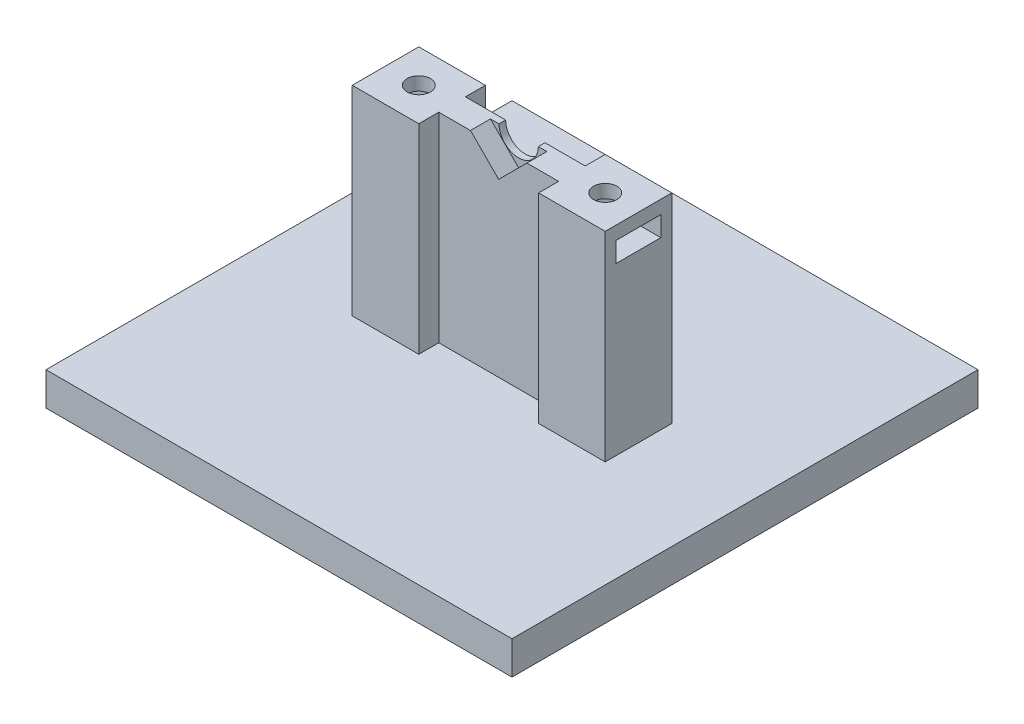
from build123d import *

# Parameters (mm, degrees)
SKETCH1_W               = 70
SKETCH1_H               = 70
BOSS_EXTRUDE1_DEPTH     = 5
SKETCH2_W               = 18
SKETCH2_H               = 4
BOSS_EXTRUDE2_DEPTH     = 30
CUT_EXTRUDE1_DEPTH      = 3
SKETCH4_R               = 2.95
CUT_EXTRUDE2_DEPTH      = 62.798058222
SKETCH5_R               = 1.75
CUT_EXTRUDE3_DEPTH      = 3
CUT_EXTRUDE4_DEPTH      = 60.489494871
CUT_EXTRUDE4_DEPTH_BACK = 60.489494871
SKETCH5_2_R             = 1.75
CUT_EXTRUDE5_START      = -5
SKETCH6_W               = 6.697263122
SKETCH6_H               = 3
CUT_EXTRUDE5_DEPTH      = 5
CUT_EXTRUDE6_START      = -5
SKETCH7_W               = 6.697263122
SKETCH7_H               = 3
CUT_EXTRUDE6_DEPTH      = 5


with BuildPart() as part:
    # Sketch1 → Boss-Extrude1 (new body)
    with BuildSketch(Plane(origin=(0, 0, 0), x_dir=(1, 0, 0), z_dir=(0, 1, 0))):
        Rectangle(SKETCH1_W, SKETCH1_H)
    extrude(amount=BOSS_EXTRUDE1_DEPTH)

    # Sketch2 → Boss-Extrude2 (add)
    with BuildSketch(Plane(origin=(0, 5, 0), x_dir=(1, 0, 0), z_dir=(0, 1, 0))):
        Polygon((-9, -5), (-9, -2), (-9, 2), (-9, 5), (-19, 5), (-19, -5), align=None)
        Rectangle(SKETCH2_W, SKETCH2_H)
        Polygon((9, 2), (9, -2), (9, -5), (19, -5), (19, 5), (9, 5), align=None)
    extrude(amount=BOSS_EXTRUDE2_DEPTH)

    # Sketch3 → Cut-Extrude1 (cut)
    with BuildSketch(Plane.XY.offset(2)):
        with BuildLine():
            ThreePointArc((2.121320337, 32.87867965), (-1.2e-08, 32), (-2.121320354, 32.878679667))
            Line((-2.121320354, 32.878679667), (0, 30.757359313))
            Line((0, 30.757359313), (2.121320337, 32.87867965))
        make_face()
        with BuildLine():
            Line((-3, 35), (-4.242640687, 35))
            Line((-4.242640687, 35), (-2.121320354, 32.878679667))
            ThreePointArc((-2.121320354, 32.878679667), (-2.7716386, 33.85194971), (-3, 35))
        make_face()
        with BuildLine():
            ThreePointArc((-3, 35), (-2.7716386, 33.85194971), (-2.121320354, 32.878679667))
            ThreePointArc((-2.121320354, 32.878679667), (-1.2e-08, 32), (2.121320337, 32.87867965))
            ThreePointArc((2.121320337, 32.87867965), (2.771638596, 33.851949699), (3, 35))
            Line((3, 35), (-3, 35))
        make_face()
        with BuildLine():
            ThreePointArc((3, 35), (0, 38), (-3, 35))
            Line((-3, 35), (3, 35))
        make_face()
        with BuildLine():
            ThreePointArc((3, 35), (2.771638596, 33.851949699), (2.121320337, 32.87867965))
            Line((2.121320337, 32.87867965), (4.242640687, 35))
            Line((4.242640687, 35), (3, 35))
        make_face()
    extrude(amount=-CUT_EXTRUDE1_DEPTH, mode=Mode.SUBTRACT)

    # Sketch4 → Cut-Extrude2 (cut, through all)
    with BuildSketch(Plane.XY.offset(2)):
        with Locations((0, 35)):
            Circle(SKETCH4_R)
    extrude(amount=-CUT_EXTRUDE2_DEPTH, mode=Mode.SUBTRACT)

    # Sketch5 → Cut-Extrude3 (cut)
    # profile 1 of 2: a face of its own
    with BuildSketch(Plane(origin=(0, 33, 0), x_dir=(1, 0, 0), z_dir=(0, 1, 0))):
        Polygon((-14, 3.348631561), (-16.9, 1.674315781), (-16.9, -1.674315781), (-14, -3.348631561), (-11.1, -1.674315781), (-11.1, 1.674315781), align=None)
        with Locations(Location((-14, 0, 0), (0, 0, 270))):
            Circle(SKETCH5_R, mode=Mode.SUBTRACT)
    # profile 2 of 2: a face of its own
    with BuildSketch(Plane(origin=(0, 33, 0), x_dir=(1, 0, 0), z_dir=(0, 1, 0))):
        Polygon((14, 3.348631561), (11.1, 1.674315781), (11.1, -1.674315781), (14, -3.348631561), (16.9, -1.674315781), (16.9, 1.674315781), align=None)
        with Locations(Location((14, 0, 0), (0, 0, 270))):
            Circle(SKETCH5_R, mode=Mode.SUBTRACT)
    extrude(amount=-CUT_EXTRUDE3_DEPTH, mode=Mode.SUBTRACT)

    # Sketch5_2 → Cut-Extrude4 (cut, two sides: drawn at the far end of the back side and taken through both)
    with BuildSketch(Plane(origin=(0, 33, 0), x_dir=(1, 0, 0), z_dir=(0, 1, 0)).offset(-CUT_EXTRUDE4_DEPTH_BACK)):
        with Locations(Location((-14, 0, 0), (0, 0, 270))):
            Circle(SKETCH5_2_R)
        with Locations(Location((14, 0, 0), (0, 0, 270))):
            Circle(SKETCH5_2_R)
    extrude(amount=CUT_EXTRUDE4_DEPTH + CUT_EXTRUDE4_DEPTH_BACK, mode=Mode.SUBTRACT)

    # Sketch6 → Cut-Extrude5 (cut)
    with BuildSketch(Plane.ZY.offset(19).offset(CUT_EXTRUDE5_START)):
        with Locations((0, 31.5)):
            Rectangle(SKETCH6_W, SKETCH6_H)
    extrude(amount=CUT_EXTRUDE5_DEPTH, mode=Mode.SUBTRACT)

    # Sketch7 → Cut-Extrude6 (cut)
    with BuildSketch(Plane(origin=(19, 0, 0), x_dir=(0, 0, -1), z_dir=(1, 0, 0)).offset(CUT_EXTRUDE6_START)):
        with Locations((0, 31.5)):
            Rectangle(SKETCH7_W, SKETCH7_H)
    extrude(amount=CUT_EXTRUDE6_DEPTH, mode=Mode.SUBTRACT)


solid = part.part
